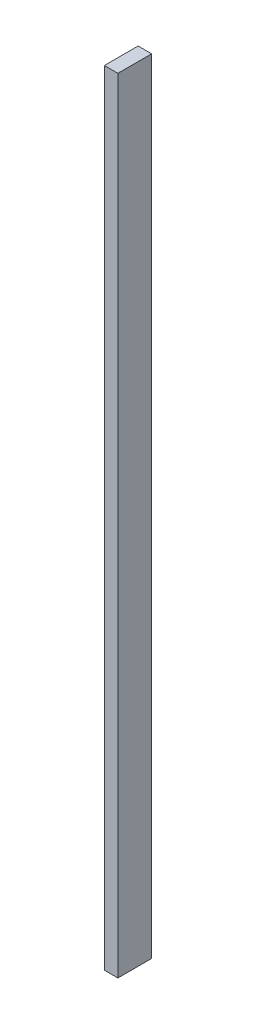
from build123d import *

# Parameters (mm, degrees)
ESQUISSE1_W      = 20
ESQUISSE1_H      = 50
EXTRUSION1_DEPTH = 1160


with BuildPart() as part:
    # Esquisse1 → Extrusion1 (new body)
    with BuildSketch(Plane(origin=(0, 0, 0), x_dir=(1, 0, 0), z_dir=(0, 1, 0))):
        with Locations((10, 25)):
            Rectangle(ESQUISSE1_W, ESQUISSE1_H)
    extrude(amount=EXTRUSION1_DEPTH)


solid = part.part
